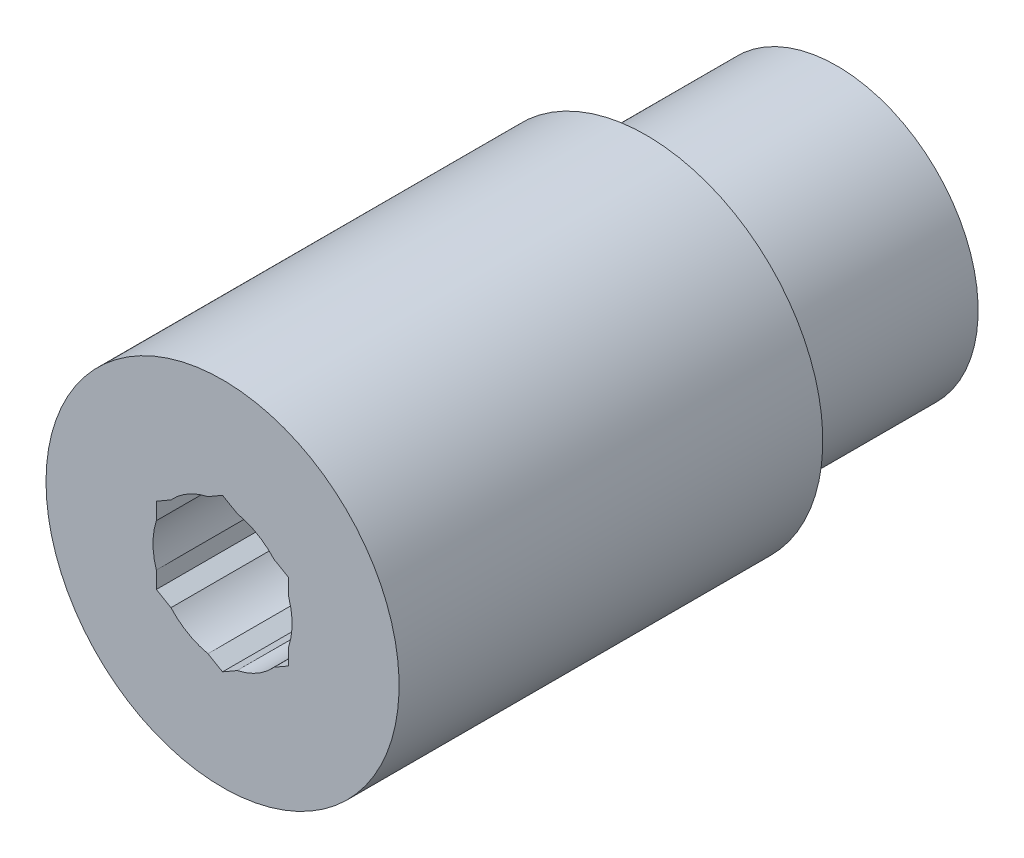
from build123d import *

# Parameters (mm, degrees)
CUT_EXTRUDE1_DEPTH = 24.853020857


with BuildPart() as part:
    # Sketch1 → Revolve1 (revolve)
    with BuildSketch(Plane(origin=(0, 0, 0), x_dir=(1, 0, 0), z_dir=(0, 1, 0))):
        Polygon((-2.5019, -36.766363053), (-6.35, -36.766363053), (-6.35, -21.526363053), (-5.08, -21.526363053), (-5.08, -14.668363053), (-2.5019, -14.668363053), align=None)
    revolve(axis=Axis((0, 0, -83.406454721), (0, 0, 1)))

    # Sketch2 → Cut-Extrude1 (cut, through all)
    with BuildSketch(Plane(origin=(0, 0, 14.668363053), x_dir=(-1, 0, 0), z_dir=(0, 0, -1))):
        Polygon((0, 2.749630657), (-2.38125, 1.374815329), (-2.38125, -1.374815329), (0, -2.749630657), (2.38125, -1.374815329), (2.38125, 1.374815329), align=None)
    extrude(amount=-CUT_EXTRUDE1_DEPTH, mode=Mode.SUBTRACT)


solid = part.part
